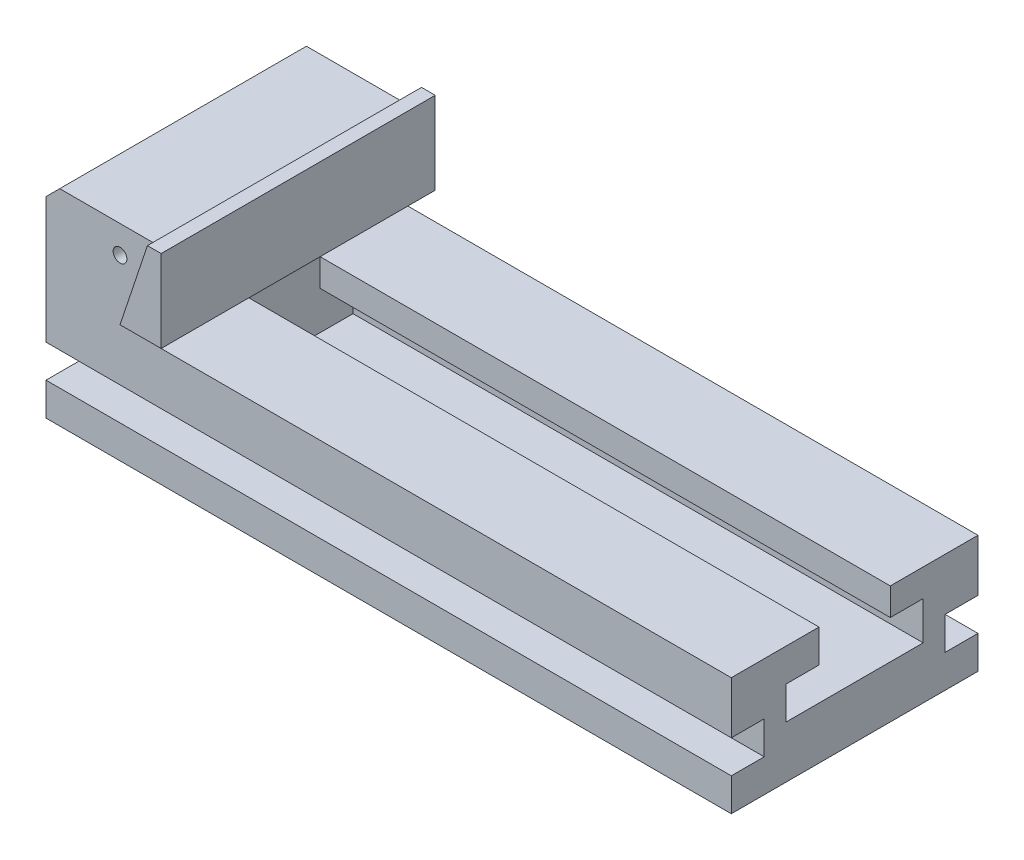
from build123d import *

# Parameters (mm, degrees)
BASE_EXTRUSION_DEPTH    = 90
CHANFREIN1_SIZE         = 5
ENL_V_MAT_EXTRU_1_DEPTH = 208
ESQUISSE10_W            = 12
ESQUISSE10_H            = 12
ENL_V_MAT_EXTRU_3_DEPTH = 277.088753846
BOSS_EXTRU_1_DEPTH      = 5
BOSS_EXTRU_1_DEPTH_BACK = 95
PER_AGE2_D              = 4
PER_AGE2_DEPTH          = 30
PER_AGE2_CBORE_D        = 5
PER_AGE2_CBORE_DEPTH    = 16
PER_AGE2_TIP            = 1.201721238


with BuildPart() as part:
    # Esquisse3 → Base-Extrusion (new body)
    with BuildSketch(Plane.XY):
        Polygon((0, 0), (-250, 0), (-250, 75), (-203, 75), (-203, 48), (-208, 48), (-208, 43), (0, 43), align=None)
    extrude(amount=BASE_EXTRUSION_DEPTH)

    # Chanfrein1
    chanfrein1_edges = [part.edges().sort_by_distance(p)[0] for p in [
        (-250, 75, 45),
    ]]
    chamfer(chanfrein1_edges, length=CHANFREIN1_SIZE)

    # Esquisse8 → Enl_v. mat.-Extru.1 (cut)
    with BuildSketch(Plane(origin=(0, 0, 0), x_dir=(0, 0, -1), z_dir=(1, 0, 0))):
        Polygon((-58, 43), (-58, 31), (-70, 31), (-70, 19), (-20, 19), (-20, 33), (-32, 33), (-32, 43), align=None)
    extrude(amount=-ENL_V_MAT_EXTRU_1_DEPTH, mode=Mode.SUBTRACT)

    # Esquisse10 → Enl_v. mat.-Extru.3 (cut, through all)
    with BuildSketch(Plane(origin=(0, 0, 0), x_dir=(0, 0, -1), z_dir=(1, 0, 0))):
        with Locations((-84, 18)):
            Rectangle(ESQUISSE10_W, ESQUISSE10_H)
    enl_v_mat_extru_3 = extrude(amount=-ENL_V_MAT_EXTRU_3_DEPTH, mode=Mode.SUBTRACT)

    # Esquisse13 → Boss.-Extru.1 (add, two sides: drawn at the far end of the back side and taken through both)
    with BuildSketch(Plane.XY.offset(90).offset(-BOSS_EXTRU_1_DEPTH_BACK)):
        Polygon((-203, 78), (-203, 48), (-218, 48), (-208, 78), align=None)
    extrude(amount=BOSS_EXTRU_1_DEPTH + BOSS_EXTRU_1_DEPTH_BACK)

    # Sym_trie1: Enl_v. mat.-Extru.3 across plane
    add(enl_v_mat_extru_3.mirror(Plane.XY.offset(45)), mode=Mode.SUBTRACT)

    # Per_age2
    with Locations(Plane.XY.offset(90)):
        with Locations((-223, 65)):
            CounterBoreHole(PER_AGE2_D / 2, PER_AGE2_CBORE_D / 2, PER_AGE2_CBORE_DEPTH, depth=PER_AGE2_DEPTH)
            with Locations((0, 0, -(PER_AGE2_DEPTH + PER_AGE2_TIP / 2))):  # 118° drill point
                Cone(0, PER_AGE2_D / 2, PER_AGE2_TIP, mode=Mode.SUBTRACT)


solid = part.part
